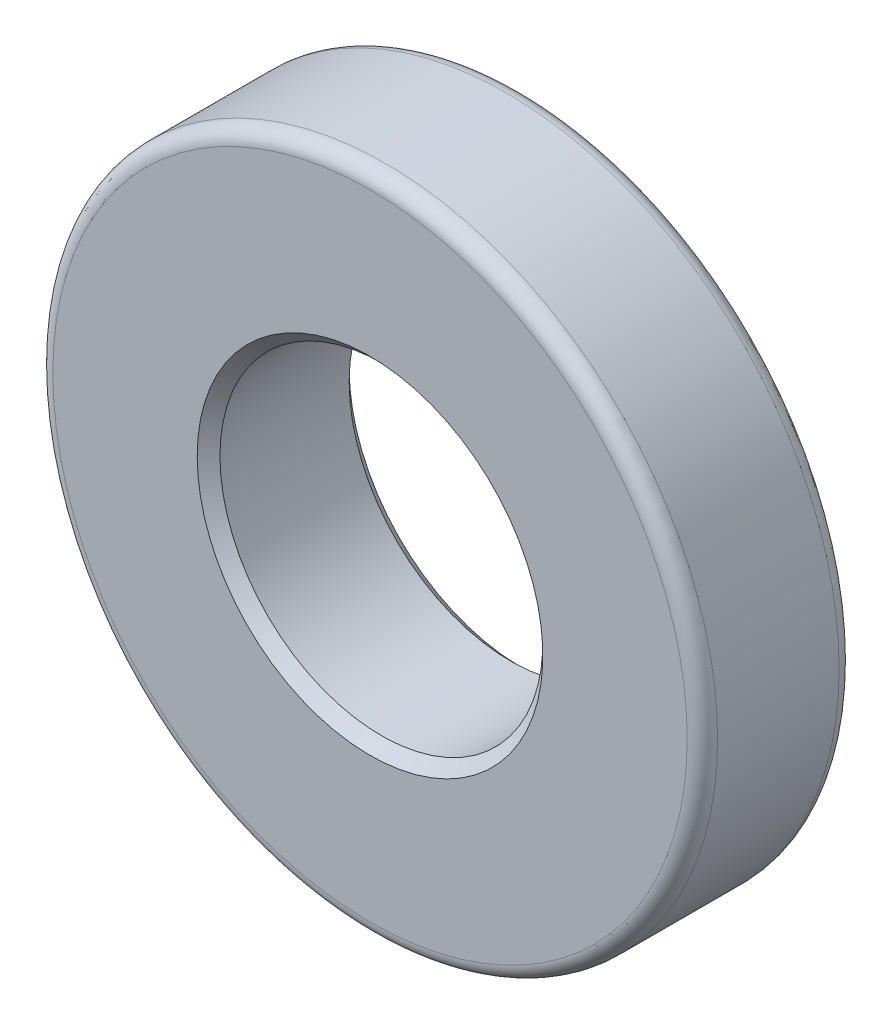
ISO-10303-21;
HEADER;
FILE_DESCRIPTION(('STEP AP214'),'2;1');
FILE_NAME('part.step','',(''),(''),'','','');
FILE_SCHEMA(('AUTOMOTIVE_DESIGN { 1 0 10303 214 1 1 1 1 }'));
ENDSEC;
DATA;
#1=APPLICATION_CONTEXT('core data for automotive mechanical design processes');
#2=APPLICATION_PROTOCOL_DEFINITION('international standard','automotive_design',2000,#1);
#3=PRODUCT_CONTEXT('',#1,'mechanical');
#4=PRODUCT('Part','Part','',(#3));
#5=PRODUCT_RELATED_PRODUCT_CATEGORY('part','',(#4));
#6=PRODUCT_DEFINITION_FORMATION('','',#4);
#7=PRODUCT_DEFINITION_CONTEXT('part definition',#1,'design');
#8=PRODUCT_DEFINITION('design','',#6,#7);
#9=PRODUCT_DEFINITION_SHAPE('','',#8);
#10=(LENGTH_UNIT() NAMED_UNIT(*) SI_UNIT(.MILLI.,.METRE.));
#11=(NAMED_UNIT(*) PLANE_ANGLE_UNIT() SI_UNIT($,.RADIAN.));
#12=(NAMED_UNIT(*) SI_UNIT($,.STERADIAN.) SOLID_ANGLE_UNIT());
#13=UNCERTAINTY_MEASURE_WITH_UNIT(LENGTH_MEASURE(1.E-05),#10,'distance_accuracy_value','');
#14=(GEOMETRIC_REPRESENTATION_CONTEXT(3) GLOBAL_UNCERTAINTY_ASSIGNED_CONTEXT((#13)) GLOBAL_UNIT_ASSIGNED_CONTEXT((#10,
#11,#12)) REPRESENTATION_CONTEXT('',''));
#15=CARTESIAN_POINT('',(0.,0.,0.));
#16=DIRECTION('',(0.,0.,1.));
#17=DIRECTION('',(1.,0.,0.));
#18=AXIS2_PLACEMENT_3D('',#15,#16,#17);
#19=CARTESIAN_POINT('',(0.,0.,8.));
#20=DIRECTION('',(0.,0.,-1.));
#21=DIRECTION('',(-1.,0.,0.));
#22=AXIS2_PLACEMENT_3D('',#19,#20,#21);
#23=CYLINDRICAL_SURFACE('',#22,8.5);
#24=CARTESIAN_POINT('',(0.,0.,0.6));
#25=DIRECTION('',(0.,0.,-1.));
#26=DIRECTION('',(-1.,0.,0.));
#27=AXIS2_PLACEMENT_3D('',#24,#25,#26);
#28=CIRCLE('',#27,8.5);
#29=CARTESIAN_POINT('',(-8.5,0.,0.6));
#30=VERTEX_POINT('',#29);
#31=EDGE_CURVE('E23',#30,#30,#28,.T.);
#32=ORIENTED_EDGE('',*,*,#31,.T.);
#33=EDGE_LOOP('',(#32));
#34=FACE_BOUND('',#33,.T.);
#35=CARTESIAN_POINT('',(0.,0.,7.4));
#36=DIRECTION('',(0.,0.,-1.));
#37=DIRECTION('',(-1.,0.,0.));
#38=AXIS2_PLACEMENT_3D('',#35,#36,#37);
#39=CIRCLE('',#38,8.5);
#40=CARTESIAN_POINT('',(-8.5,0.,7.4));
#41=VERTEX_POINT('',#40);
#42=EDGE_CURVE('E27',#41,#41,#39,.F.);
#43=ORIENTED_EDGE('',*,*,#42,.T.);
#44=EDGE_LOOP('',(#43));
#45=FACE_BOUND('',#44,.T.);
#46=ADVANCED_FACE('F12',(#34,#45),#23,.F.);
#47=CARTESIAN_POINT('',(0.,0.,8.));
#48=DIRECTION('',(0.,0.,-1.));
#49=DIRECTION('',(-1.,0.,0.));
#50=AXIS2_PLACEMENT_3D('',#47,#48,#49);
#51=CYLINDRICAL_SURFACE('',#50,17.5);
#52=CARTESIAN_POINT('',(0.,0.,0.8));
#53=DIRECTION('',(0.,0.,-1.));
#54=DIRECTION('',(-1.,0.,0.));
#55=AXIS2_PLACEMENT_3D('',#52,#53,#54);
#56=CIRCLE('',#55,17.5);
#57=CARTESIAN_POINT('',(-17.5,0.,0.8));
#58=VERTEX_POINT('',#57);
#59=EDGE_CURVE('E32',#58,#58,#56,.F.);
#60=ORIENTED_EDGE('',*,*,#59,.T.);
#61=EDGE_LOOP('',(#60));
#62=FACE_BOUND('',#61,.T.);
#63=CARTESIAN_POINT('',(0.,0.,7.2));
#64=DIRECTION('',(0.,0.,-1.));
#65=DIRECTION('',(-1.,0.,0.));
#66=AXIS2_PLACEMENT_3D('',#63,#64,#65);
#67=CIRCLE('',#66,17.5);
#68=CARTESIAN_POINT('',(-17.5,0.,7.2));
#69=VERTEX_POINT('',#68);
#70=EDGE_CURVE('E41',#69,#69,#67,.T.);
#71=ORIENTED_EDGE('',*,*,#70,.T.);
#72=EDGE_LOOP('',(#71));
#73=FACE_BOUND('',#72,.T.);
#74=ADVANCED_FACE('F14',(#62,#73),#51,.T.);
#75=CARTESIAN_POINT('',(0.,0.,8.));
#76=DIRECTION('',(0.,0.,-1.));
#77=DIRECTION('',(-1.,0.,0.));
#78=AXIS2_PLACEMENT_3D('',#75,#76,#77);
#79=PLANE('',#78);
#80=CARTESIAN_POINT('',(0.,0.,8.));
#81=DIRECTION('',(0.,0.,-1.));
#82=DIRECTION('',(-1.,0.,0.));
#83=AXIS2_PLACEMENT_3D('',#80,#81,#82);
#84=CIRCLE('',#83,9.1);
#85=CARTESIAN_POINT('',(-9.1,0.,8.));
#86=VERTEX_POINT('',#85);
#87=EDGE_CURVE('E8',#86,#86,#84,.T.);
#88=ORIENTED_EDGE('',*,*,#87,.T.);
#89=EDGE_LOOP('',(#88));
#90=FACE_BOUND('',#89,.T.);
#91=CARTESIAN_POINT('',(0.,0.,8.));
#92=DIRECTION('',(0.,0.,-1.));
#93=DIRECTION('',(-1.,0.,0.));
#94=AXIS2_PLACEMENT_3D('',#91,#92,#93);
#95=CIRCLE('',#94,16.7);
#96=CARTESIAN_POINT('',(-16.7,0.,8.));
#97=VERTEX_POINT('',#96);
#98=EDGE_CURVE('E38',#97,#97,#95,.F.);
#99=ORIENTED_EDGE('',*,*,#98,.T.);
#100=EDGE_LOOP('',(#99));
#101=FACE_BOUND('',#100,.T.);
#102=ADVANCED_FACE('F60',(#90,#101),#79,.F.);
#103=CARTESIAN_POINT('',(0.,0.,0.));
#104=DIRECTION('',(0.,0.,-1.));
#105=DIRECTION('',(-1.,0.,0.));
#106=AXIS2_PLACEMENT_3D('',#103,#104,#105);
#107=PLANE('',#106);
#108=CARTESIAN_POINT('',(0.,0.,0.));
#109=DIRECTION('',(0.,0.,-1.));
#110=DIRECTION('',(-1.,0.,0.));
#111=AXIS2_PLACEMENT_3D('',#108,#109,#110);
#112=CIRCLE('',#111,9.1);
#113=CARTESIAN_POINT('',(-9.1,0.,0.));
#114=VERTEX_POINT('',#113);
#115=EDGE_CURVE('E19',#114,#114,#112,.F.);
#116=ORIENTED_EDGE('',*,*,#115,.T.);
#117=EDGE_LOOP('',(#116));
#118=FACE_BOUND('',#117,.T.);
#119=CARTESIAN_POINT('',(0.,0.,0.));
#120=DIRECTION('',(0.,0.,-1.));
#121=DIRECTION('',(-1.,0.,0.));
#122=AXIS2_PLACEMENT_3D('',#119,#120,#121);
#123=CIRCLE('',#122,16.7);
#124=CARTESIAN_POINT('',(-16.7,0.,0.));
#125=VERTEX_POINT('',#124);
#126=EDGE_CURVE('E35',#125,#125,#123,.T.);
#127=ORIENTED_EDGE('',*,*,#126,.T.);
#128=EDGE_LOOP('',(#127));
#129=FACE_BOUND('',#128,.T.);
#130=ADVANCED_FACE('F49',(#118,#129),#107,.T.);
#131=CARTESIAN_POINT('',(0.,0.,7.2));
#132=DIRECTION('',(0.,0.,-1.));
#133=DIRECTION('',(-1.,0.,0.));
#134=AXIS2_PLACEMENT_3D('',#131,#132,#133);
#135=TOROIDAL_SURFACE('',#134,16.7,0.8);
#136=ORIENTED_EDGE('',*,*,#98,.F.);
#137=EDGE_LOOP('',(#136));
#138=FACE_BOUND('',#137,.T.);
#139=ORIENTED_EDGE('',*,*,#70,.F.);
#140=EDGE_LOOP('',(#139));
#141=FACE_BOUND('',#140,.T.);
#142=ADVANCED_FACE('F46',(#138,#141),#135,.T.);
#143=CARTESIAN_POINT('',(0.,0.,0.8));
#144=DIRECTION('',(0.,0.,-1.));
#145=DIRECTION('',(-1.,0.,0.));
#146=AXIS2_PLACEMENT_3D('',#143,#144,#145);
#147=TOROIDAL_SURFACE('',#146,16.7,0.8);
#148=ORIENTED_EDGE('',*,*,#59,.F.);
#149=EDGE_LOOP('',(#148));
#150=FACE_BOUND('',#149,.T.);
#151=ORIENTED_EDGE('',*,*,#126,.F.);
#152=EDGE_LOOP('',(#151));
#153=FACE_BOUND('',#152,.T.);
#154=ADVANCED_FACE('F48',(#150,#153),#147,.T.);
#155=CARTESIAN_POINT('',(0.,0.,0.6));
#156=DIRECTION('',(0.,0.,-1.));
#157=DIRECTION('',(-1.,0.,0.));
#158=AXIS2_PLACEMENT_3D('',#155,#156,#157);
#159=CONICAL_SURFACE('',#158,8.5,0.785398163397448);
#160=ORIENTED_EDGE('',*,*,#115,.F.);
#161=EDGE_LOOP('',(#160));
#162=FACE_BOUND('',#161,.T.);
#163=ORIENTED_EDGE('',*,*,#31,.F.);
#164=EDGE_LOOP('',(#163));
#165=FACE_BOUND('',#164,.T.);
#166=ADVANCED_FACE('F57',(#162,#165),#159,.F.);
#167=CARTESIAN_POINT('',(0.,0.,8.));
#168=DIRECTION('',(0.,0.,1.));
#169=DIRECTION('',(1.,0.,0.));
#170=AXIS2_PLACEMENT_3D('',#167,#168,#169);
#171=CONICAL_SURFACE('',#170,9.1,0.785398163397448);
#172=ORIENTED_EDGE('',*,*,#42,.F.);
#173=EDGE_LOOP('',(#172));
#174=FACE_BOUND('',#173,.T.);
#175=ORIENTED_EDGE('',*,*,#87,.F.);
#176=EDGE_LOOP('',(#175));
#177=FACE_BOUND('',#176,.T.);
#178=ADVANCED_FACE('F110',(#174,#177),#171,.F.);
#179=CLOSED_SHELL('',(#46,#74,#102,#130,#142,#154,#166,#178));
#180=MANIFOLD_SOLID_BREP('B1',#179);
#181=ADVANCED_BREP_SHAPE_REPRESENTATION('',(#18,#180),#14);
#182=SHAPE_DEFINITION_REPRESENTATION(#9,#181);
ENDSEC;
END-ISO-10303-21;
